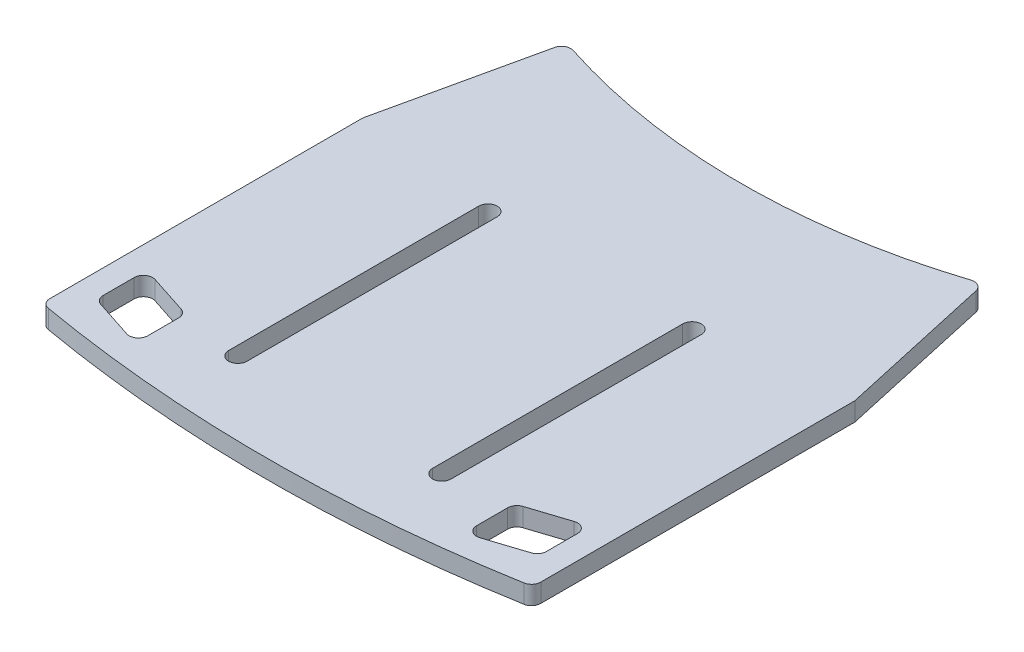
from build123d import *

# Parameters (mm, degrees)
RESSALTO_EXTRUS_O1_DEPTH = 2


with BuildPart() as part:
    # Esbo_o1 → Ressalto-extrus_o1 (new body)
    with BuildSketch(Plane(origin=(0, 0, 0), x_dir=(1, 0, 0), z_dir=(0, 1, 0))):
        with BuildLine():
            Line((-22.739996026, 26.420017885), (-26.47618706, 9.607158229))
            ThreePointArc((-26.47618706, 9.607158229), (-26.494028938, 9.499344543), (-26.5, 9.390227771))
            Line((-26.5, 9.390227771), (-26.5, -24.299313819))
            ThreePointArc((-26.5, -24.299313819), (-26.265286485, -24.943003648), (-25.671326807, -25.284528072))
            ThreePointArc((-25.671326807, -25.284528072), (0, -27.5), (25.671326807, -25.284528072))
            ThreePointArc((25.671326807, -25.284528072), (26.265286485, -24.943003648), (26.5, -24.299313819))
            Line((26.5, -24.299313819), (26.5, 9.607158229))
            Line((26.5, 9.607158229), (22.763808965, 26.420017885))
            ThreePointArc((22.763808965, 26.420017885), (22.284676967, 27.070806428), (21.480921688, 27.154893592))
            ThreePointArc((21.480921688, 27.154893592), (10.878133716, 24.629860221), (0.01190647, 23.781325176))
            ThreePointArc((0.01190647, 23.781325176), (-10.854320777, 24.629860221), (-21.457108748, 27.154893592))
            ThreePointArc((-21.457108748, 27.154893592), (-22.260864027, 27.070806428), (-22.739996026, 26.420017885))
        make_face()
        with BuildLine():
            Line((23.945153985, -17.77729625), (23.945153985, -21.127458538))
            ThreePointArc((23.945153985, -21.127458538), (23.754375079, -21.714962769), (23.254831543, -22.07830017))
            Line((23.254831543, -22.07830017), (19.076176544, -23.439237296))
            ThreePointArc((19.076176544, -23.439237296), (18.178994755, -23.297616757), (17.766498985, -22.488395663))
            Line((17.766498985, -22.488395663), (17.766498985, -19.138233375))
            ThreePointArc((17.766498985, -19.138233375), (17.957277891, -18.550729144), (18.456821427, -18.187391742))
            Line((18.456821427, -18.187391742), (22.635476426, -16.826454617))
            ThreePointArc((22.635476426, -16.826454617), (23.532658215, -16.968075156), (23.945153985, -17.77729625))
        make_face(mode=Mode.SUBTRACT)
        with BuildLine():
            Line((-10, 7.500138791), (-10, -19.499861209))
            ThreePointArc((-10, -19.499861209), (-11, -20.499861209), (-12, -19.499861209))
            Line((-12, -19.499861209), (-12, 7.500138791))
            ThreePointArc((-12, 7.500138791), (-11, 8.500138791), (-10, 7.500138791))
        make_face(mode=Mode.SUBTRACT)
        with BuildLine():
            Line((-23.231018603, -22.07830017), (-19.052363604, -23.439237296))
            ThreePointArc((-19.052363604, -23.439237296), (-18.155181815, -23.297616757), (-17.742686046, -22.488395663))
            Line((-17.742686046, -22.488395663), (-17.742686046, -19.138233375))
            ThreePointArc((-17.742686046, -19.138233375), (-17.933464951, -18.550729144), (-18.433008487, -18.187391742))
            Line((-18.433008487, -18.187391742), (-22.611663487, -16.826454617))
            ThreePointArc((-22.611663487, -16.826454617), (-23.508845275, -16.968075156), (-23.921341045, -17.77729625))
            Line((-23.921341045, -17.77729625), (-23.921341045, -21.127458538))
            ThreePointArc((-23.921341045, -21.127458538), (-23.730562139, -21.714962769), (-23.231018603, -22.07830017))
        make_face(mode=Mode.SUBTRACT)
        with BuildLine():
            Line((10.02381294, 7.500138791), (10.02381294, -19.499861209))
            ThreePointArc((10.02381294, -19.499861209), (11.02381294, -20.499861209), (12.02381294, -19.499861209))
            Line((12.02381294, -19.499861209), (12.02381294, 7.500138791))
            ThreePointArc((12.02381294, 7.500138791), (11.02381294, 8.500138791), (10.02381294, 7.500138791))
        make_face(mode=Mode.SUBTRACT)
    extrude(amount=RESSALTO_EXTRUS_O1_DEPTH)


solid = part.part
